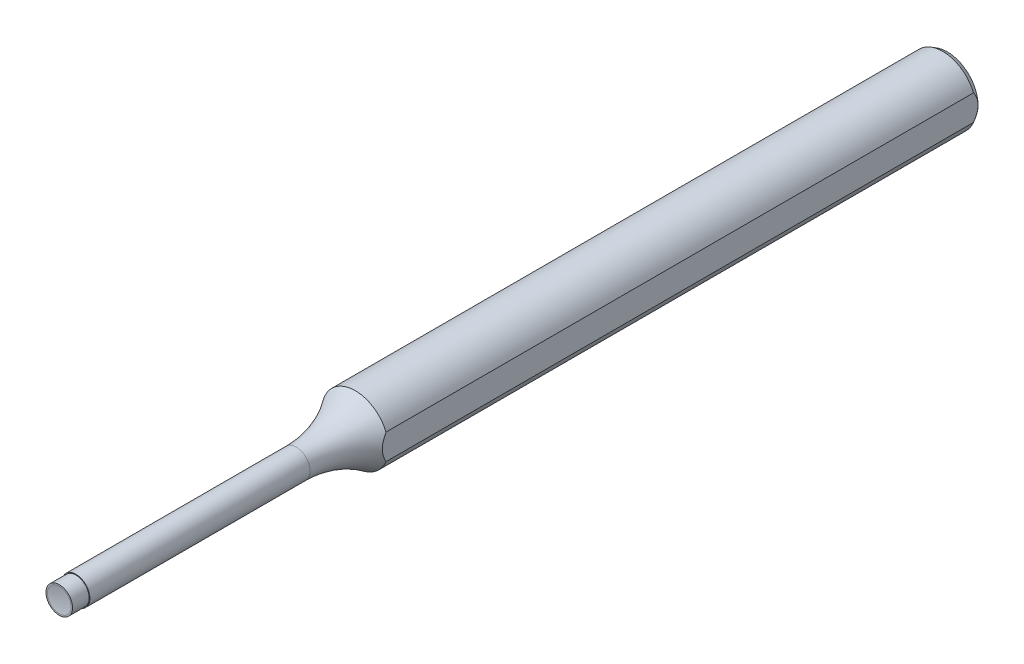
ISO-10303-21;
HEADER;
FILE_DESCRIPTION(('STEP AP214'),'2;1');
FILE_NAME('part.step','',(''),(''),'','','');
FILE_SCHEMA(('AUTOMOTIVE_DESIGN { 1 0 10303 214 1 1 1 1 }'));
ENDSEC;
DATA;
#1=APPLICATION_CONTEXT('core data for automotive mechanical design processes');
#2=APPLICATION_PROTOCOL_DEFINITION('international standard','automotive_design',2000,#1);
#3=PRODUCT_CONTEXT('',#1,'mechanical');
#4=PRODUCT('Part','Part','',(#3));
#5=PRODUCT_RELATED_PRODUCT_CATEGORY('part','',(#4));
#6=PRODUCT_DEFINITION_FORMATION('','',#4);
#7=PRODUCT_DEFINITION_CONTEXT('part definition',#1,'design');
#8=PRODUCT_DEFINITION('design','',#6,#7);
#9=PRODUCT_DEFINITION_SHAPE('','',#8);
#10=(LENGTH_UNIT() NAMED_UNIT(*) SI_UNIT(.MILLI.,.METRE.));
#11=(NAMED_UNIT(*) PLANE_ANGLE_UNIT() SI_UNIT($,.RADIAN.));
#12=(NAMED_UNIT(*) SI_UNIT($,.STERADIAN.) SOLID_ANGLE_UNIT());
#13=UNCERTAINTY_MEASURE_WITH_UNIT(LENGTH_MEASURE(1.E-05),#10,'distance_accuracy_value','');
#14=(GEOMETRIC_REPRESENTATION_CONTEXT(3) GLOBAL_UNCERTAINTY_ASSIGNED_CONTEXT((#13)) GLOBAL_UNIT_ASSIGNED_CONTEXT((#10,
#11,#12)) REPRESENTATION_CONTEXT('',''));
#15=CARTESIAN_POINT('',(0.,0.,0.));
#16=DIRECTION('',(0.,0.,1.));
#17=DIRECTION('',(1.,0.,0.));
#18=AXIS2_PLACEMENT_3D('',#15,#16,#17);
#19=CARTESIAN_POINT('',(0.,0.,-42.3333333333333));
#20=DIRECTION('',(0.,0.,1.));
#21=DIRECTION('',(1.,0.,0.));
#22=AXIS2_PLACEMENT_3D('',#19,#20,#21);
#23=CYLINDRICAL_SURFACE('',#22,2.);
#24=CARTESIAN_POINT('',(0.,0.,-33.8831188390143));
#25=DIRECTION('',(0.,0.,1.));
#26=DIRECTION('',(0.,-1.,0.));
#27=AXIS2_PLACEMENT_3D('',#24,#25,#26);
#28=CIRCLE('',#27,2.);
#29=CARTESIAN_POINT('',(0.,-2.,-33.8831188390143));
#30=VERTEX_POINT('',#29);
#31=EDGE_CURVE('E79',#30,#30,#28,.F.);
#32=ORIENTED_EDGE('',*,*,#31,.F.);
#33=EDGE_LOOP('',(#32));
#34=FACE_BOUND('',#33,.T.);
#35=CARTESIAN_POINT('',(0.,0.,-2.3825));
#36=DIRECTION('',(0.,0.,1.));
#37=DIRECTION('',(1.,0.,0.));
#38=AXIS2_PLACEMENT_3D('',#35,#36,#37);
#39=CIRCLE('',#38,2.);
#40=CARTESIAN_POINT('',(2.,0.,-2.3825));
#41=VERTEX_POINT('',#40);
#42=EDGE_CURVE('E90',#41,#41,#39,.F.);
#43=ORIENTED_EDGE('',*,*,#42,.T.);
#44=EDGE_LOOP('',(#43));
#45=FACE_BOUND('',#44,.T.);
#46=ADVANCED_FACE('F42',(#34,#45),#23,.T.);
#47=CARTESIAN_POINT('',(0.,0.,-2.3825));
#48=DIRECTION('',(0.,0.,1.));
#49=DIRECTION('',(1.,0.,0.));
#50=AXIS2_PLACEMENT_3D('',#47,#48,#49);
#51=PLANE('',#50);
#52=ORIENTED_EDGE('',*,*,#42,.F.);
#53=EDGE_LOOP('',(#52));
#54=FACE_BOUND('',#53,.T.);
#55=CARTESIAN_POINT('',(0.,0.,-2.3825));
#56=DIRECTION('',(0.,0.,1.));
#57=DIRECTION('',(1.,0.,0.));
#58=AXIS2_PLACEMENT_3D('',#55,#56,#57);
#59=CIRCLE('',#58,1.9);
#60=CARTESIAN_POINT('',(1.9,0.,-2.3825));
#61=VERTEX_POINT('',#60);
#62=EDGE_CURVE('E97',#61,#61,#59,.T.);
#63=ORIENTED_EDGE('',*,*,#62,.F.);
#64=EDGE_LOOP('',(#63));
#65=FACE_BOUND('',#64,.T.);
#66=ADVANCED_FACE('F109',(#54,#65),#51,.T.);
#67=CARTESIAN_POINT('',(0.,0.,-2.3825));
#68=DIRECTION('',(0.,0.,1.));
#69=DIRECTION('',(1.,0.,0.));
#70=AXIS2_PLACEMENT_3D('',#67,#68,#69);
#71=CYLINDRICAL_SURFACE('',#70,1.9);
#72=ORIENTED_EDGE('',*,*,#62,.T.);
#73=EDGE_LOOP('',(#72));
#74=FACE_BOUND('',#73,.T.);
#75=CARTESIAN_POINT('',(0.,0.,0.));
#76=DIRECTION('',(0.,0.,1.));
#77=DIRECTION('',(1.,0.,0.));
#78=AXIS2_PLACEMENT_3D('',#75,#76,#77);
#79=CIRCLE('',#78,1.9);
#80=CARTESIAN_POINT('',(1.9,0.,0.));
#81=VERTEX_POINT('',#80);
#82=EDGE_CURVE('E120',#81,#81,#79,.T.);
#83=ORIENTED_EDGE('',*,*,#82,.F.);
#84=EDGE_LOOP('',(#83));
#85=FACE_BOUND('',#84,.T.);
#86=ADVANCED_FACE('F115',(#74,#85),#71,.T.);
#87=CARTESIAN_POINT('',(0.,0.,0.));
#88=DIRECTION('',(0.,0.,1.));
#89=DIRECTION('',(1.,0.,0.));
#90=AXIS2_PLACEMENT_3D('',#87,#88,#89);
#91=PLANE('',#90);
#92=CARTESIAN_POINT('',(0.,0.,0.));
#93=DIRECTION('',(0.,0.,1.));
#94=DIRECTION('',(0.,-1.,0.));
#95=AXIS2_PLACEMENT_3D('',#92,#93,#94);
#96=CIRCLE('',#95,1.7);
#97=CARTESIAN_POINT('',(0.,-1.7,0.));
#98=VERTEX_POINT('',#97);
#99=EDGE_CURVE('E125',#98,#98,#96,.T.);
#100=ORIENTED_EDGE('',*,*,#99,.F.);
#101=EDGE_LOOP('',(#100));
#102=FACE_BOUND('',#101,.T.);
#103=ORIENTED_EDGE('',*,*,#82,.T.);
#104=EDGE_LOOP('',(#103));
#105=FACE_BOUND('',#104,.T.);
#106=ADVANCED_FACE('F157',(#102,#105),#91,.T.);
#107=CARTESIAN_POINT('',(0.,0.,9.37714775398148));
#108=DIRECTION('',(0.,0.,1.));
#109=DIRECTION('',(0.,1.,0.));
#110=AXIS2_PLACEMENT_3D('',#107,#108,#109);
#111=SPHERICAL_SURFACE('',#110,9.53);
#112=ORIENTED_EDGE('',*,*,#99,.T.);
#113=EDGE_LOOP('',(#112));
#114=FACE_BOUND('',#113,.T.);
#115=ADVANCED_FACE('F160',(#114),#111,.F.);
#116=CARTESIAN_POINT('',(0.,0.,-33.8831188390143));
#117=DIRECTION('',(0.,0.,-1.));
#118=DIRECTION('',(0.,1.,0.));
#119=AXIS2_PLACEMENT_3D('',#116,#117,#118);
#120=TOROIDAL_SURFACE('',#119,16.295,14.295);
#121=CARTESIAN_POINT('',(4.39819012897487,11.0449885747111,-47.4819999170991));
#122=CARTESIAN_POINT('',(4.39819012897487,10.7947650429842,-47.4066870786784));
#123=CARTESIAN_POINT('',(4.39819012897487,10.546290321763,-47.3256339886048));
#124=CARTESIAN_POINT('',(4.39819012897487,10.053224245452,-47.1526257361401));
#125=CARTESIAN_POINT('',(4.39819012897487,9.80863204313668,-47.0606729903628));
#126=CARTESIAN_POINT('',(4.39819012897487,9.32422528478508,-46.8666581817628));
#127=CARTESIAN_POINT('',(4.39819012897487,9.08440011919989,-46.7646225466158));
#128=CARTESIAN_POINT('',(4.39819012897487,8.60909073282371,-46.5508837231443));
#129=CARTESIAN_POINT('',(4.39819012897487,8.37360671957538,-46.4391800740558));
#130=CARTESIAN_POINT('',(4.39819012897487,7.91181699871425,-46.209176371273));
#131=CARTESIAN_POINT('',(4.39819012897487,7.68542197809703,-46.0910552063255));
#132=CARTESIAN_POINT('',(4.39819012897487,7.2368869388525,-45.846988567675));
#133=CARTESIAN_POINT('',(4.39819012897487,7.01474709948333,-45.7210427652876));
#134=CARTESIAN_POINT('',(4.39819012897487,6.57446847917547,-45.4621573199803));
#135=CARTESIAN_POINT('',(4.39819012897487,6.35633139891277,-45.3292147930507));
#136=CARTESIAN_POINT('',(4.39819012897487,5.92378803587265,-45.0574142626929));
#137=CARTESIAN_POINT('',(4.39819012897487,5.70938174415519,-44.9185562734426));
#138=CARTESIAN_POINT('',(4.39819012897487,5.29273016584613,-44.6421719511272));
#139=CARTESIAN_POINT('',(4.39819012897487,5.09035537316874,-44.5048399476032));
#140=CARTESIAN_POINT('',(4.39819012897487,4.68766106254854,-44.2272802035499));
#141=CARTESIAN_POINT('',(4.39819012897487,4.48734120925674,-44.0870529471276));
#142=CARTESIAN_POINT('',(4.39819012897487,4.08655969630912,-43.8047975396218));
#143=CARTESIAN_POINT('',(4.39819012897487,3.88610186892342,-43.6627640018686));
#144=CARTESIAN_POINT('',(4.39819012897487,3.48424347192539,-43.3800550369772));
#145=CARTESIAN_POINT('',(4.39819012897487,3.28284299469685,-43.2393794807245));
#146=CARTESIAN_POINT('',(4.39819012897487,2.92966388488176,-42.9992904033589));
#147=CARTESIAN_POINT('',(4.39819012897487,2.77868587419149,-42.8987091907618));
#148=CARTESIAN_POINT('',(4.39819012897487,2.47333321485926,-42.7025794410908));
#149=CARTESIAN_POINT('',(4.39819012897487,2.31895675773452,-42.6070336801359));
#150=CARTESIAN_POINT('',(4.39819012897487,2.005761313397,-42.4246557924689));
#151=CARTESIAN_POINT('',(4.39819012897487,1.84695880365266,-42.3377957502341));
#152=CARTESIAN_POINT('',(4.39819012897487,1.52277481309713,-42.1773799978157));
#153=CARTESIAN_POINT('',(4.39819012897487,1.35740223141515,-42.1038069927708));
#154=CARTESIAN_POINT('',(4.39819012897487,1.09987996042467,-42.007160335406));
#155=CARTESIAN_POINT('',(4.39819012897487,1.01049289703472,-41.976753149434));
#156=CARTESIAN_POINT('',(4.39819012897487,0.829699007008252,-41.9225917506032));
#157=CARTESIAN_POINT('',(4.39819012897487,0.738292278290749,-41.8988372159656));
#158=CARTESIAN_POINT('',(4.39819012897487,0.554209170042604,-41.8591940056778));
#159=CARTESIAN_POINT('',(4.39819012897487,0.461540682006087,-41.8432692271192));
#160=CARTESIAN_POINT('',(4.39819012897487,0.27512215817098,-41.8200165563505));
#161=CARTESIAN_POINT('',(4.39819012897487,0.181372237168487,-41.8126877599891));
#162=CARTESIAN_POINT('',(4.39819012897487,-0.00699658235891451,-41.807066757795));
#163=CARTESIAN_POINT('',(4.39819012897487,-0.101617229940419,-41.8088319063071));
#164=CARTESIAN_POINT('',(4.39819012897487,-0.290248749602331,-41.821416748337));
#165=CARTESIAN_POINT('',(4.39819012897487,-0.38425957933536,-41.8322370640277));
#166=CARTESIAN_POINT('',(4.39819012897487,-0.571301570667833,-41.8623308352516));
#167=CARTESIAN_POINT('',(4.39819012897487,-0.664326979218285,-41.8816395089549));
#168=CARTESIAN_POINT('',(4.39819012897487,-0.848491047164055,-41.9276817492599));
#169=CARTESIAN_POINT('',(4.39819012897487,-0.939629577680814,-41.9544158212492));
#170=CARTESIAN_POINT('',(4.39819012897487,-1.22609602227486,-42.0493425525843));
#171=CARTESIAN_POINT('',(4.39819012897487,-1.41755339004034,-42.1292488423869));
#172=CARTESIAN_POINT('',(4.39819012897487,-1.69784846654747,-42.2630803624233));
#173=CARTESIAN_POINT('',(4.39819012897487,-1.79024221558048,-42.3100867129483));
#174=CARTESIAN_POINT('',(4.39819012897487,-1.97308040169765,-42.4077596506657));
#175=CARTESIAN_POINT('',(4.39819012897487,-2.06352516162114,-42.4584256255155));
#176=CARTESIAN_POINT('',(4.39819012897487,-2.24410996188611,-42.5633271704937));
#177=CARTESIAN_POINT('',(4.39819012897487,-2.3342252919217,-42.6176047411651));
#178=CARTESIAN_POINT('',(4.39819012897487,-2.51311006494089,-42.7283328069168));
#179=CARTESIAN_POINT('',(4.39819012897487,-2.60187947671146,-42.7847833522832));
#180=CARTESIAN_POINT('',(4.39819012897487,-2.77831480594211,-42.8992495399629));
#181=CARTESIAN_POINT('',(4.39819012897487,-2.86598141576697,-42.9572641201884));
#182=CARTESIAN_POINT('',(4.39819012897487,-3.04053934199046,-43.0744413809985));
#183=CARTESIAN_POINT('',(4.39819012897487,-3.12743067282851,-43.133604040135));
#184=CARTESIAN_POINT('',(4.39819012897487,-3.37106605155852,-43.3010856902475));
#185=CARTESIAN_POINT('',(4.39819012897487,-3.52720183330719,-43.4102864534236));
#186=CARTESIAN_POINT('',(4.39819012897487,-3.83888063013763,-43.629533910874));
#187=CARTESIAN_POINT('',(4.39819012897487,-3.99442362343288,-43.7395806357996));
#188=CARTESIAN_POINT('',(4.39819012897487,-4.30578651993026,-43.9593057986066));
#189=CARTESIAN_POINT('',(4.39819012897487,-4.46160644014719,-44.0689842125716));
#190=CARTESIAN_POINT('',(4.39819012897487,-4.77416550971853,-44.2870260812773));
#191=CARTESIAN_POINT('',(4.39819012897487,-4.93090465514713,-44.3953895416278));
#192=CARTESIAN_POINT('',(4.39819012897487,-5.24552277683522,-44.6098721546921));
#193=CARTESIAN_POINT('',(4.39819012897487,-5.40339933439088,-44.7159948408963));
#194=CARTESIAN_POINT('',(4.39819012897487,-5.72090882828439,-44.9255777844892));
#195=CARTESIAN_POINT('',(4.39819012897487,-5.88054176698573,-45.0290380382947));
#196=CARTESIAN_POINT('',(4.39819012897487,-6.36249082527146,-45.3346345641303));
#197=CARTESIAN_POINT('',(4.39819012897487,-6.68787179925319,-45.5319967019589));
#198=CARTESIAN_POINT('',(4.39819012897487,-7.33445229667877,-45.9028473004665));
#199=CARTESIAN_POINT('',(4.39819012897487,-7.65527975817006,-46.0769816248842));
#200=CARTESIAN_POINT('',(4.39819012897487,-8.30567517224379,-46.4080211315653));
#201=CARTESIAN_POINT('',(4.39819012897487,-8.635241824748,-46.5649288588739));
#202=CARTESIAN_POINT('',(4.39819012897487,-9.30675508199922,-46.8612686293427));
#203=CARTESIAN_POINT('',(4.39819012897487,-9.64880070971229,-47.0004778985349));
#204=CARTESIAN_POINT('',(4.39819012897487,-10.1679107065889,-47.1932985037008));
#205=CARTESIAN_POINT('',(4.39819012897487,-10.3420274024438,-47.2549286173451));
#206=CARTESIAN_POINT('',(4.39819012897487,-10.692133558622,-47.3726581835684));
#207=CARTESIAN_POINT('',(4.39819012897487,-10.8681231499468,-47.4287572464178));
#208=CARTESIAN_POINT('',(4.39819012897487,-11.0449885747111,-47.4819999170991));
#209=B_SPLINE_CURVE_WITH_KNOTS('',3,(#121,#122,#123,#124,#125,#126,#127,#128,#129,#130,#131,
#132,#133,#134,#135,#136,#137,#138,#139,#140,#141,#142,#143,#144,#145,#146,#147,#148,#149,#150,
#151,#152,#153,#154,#155,#156,#157,#158,#159,#160,#161,#162,#163,#164,#165,#166,#167,#168,#169,
#170,#171,#172,#173,#174,#175,#176,#177,#178,#179,#180,#181,#182,#183,#184,#185,#186,#187,#188,
#189,#190,#191,#192,#193,#194,#195,#196,#197,#198,#199,#200,#201,#202,#203,#204,#205,#206,#207,
#208),.UNSPECIFIED.,.F.,.F.,(4,2,2,2,2,2,2,2,2,2,2,2,2,2,2,2,2,2,2,2,2,2,2,2,2,2,2,2,2,2,2,2,2,
2,2,2,2,2,2,2,2,2,2,4),(0.,0.783837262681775,1.56750106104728,2.34916273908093,3.13086169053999,
3.89676597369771,4.66270245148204,5.42895715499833,6.19521002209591,6.92888889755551,
7.66244607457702,8.39948186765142,9.13644688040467,9.68063581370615,10.2251216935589,
10.7677972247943,11.3097612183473,11.5928058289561,11.875836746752,12.1575500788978,
12.4392337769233,12.722696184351,13.0061780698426,13.2908473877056,13.5755360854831,
14.1959332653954,14.5069059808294,14.8178267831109,15.1333896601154,15.4489598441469,
15.7643208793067,16.0796760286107,16.6512649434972,17.2228746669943,17.7945208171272,
18.366164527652,18.9368268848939,19.507490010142,20.6487630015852,21.7434198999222,
22.8379148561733,23.9450511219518,24.499076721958,25.0531413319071),.UNSPECIFIED.);
#210=CARTESIAN_POINT('',(4.39819012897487,1.83334355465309,-42.3333333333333));
#211=VERTEX_POINT('',#210);
#212=CARTESIAN_POINT('',(4.39819012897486,-1.83334355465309,-42.3333333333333));
#213=VERTEX_POINT('',#212);
#214=EDGE_CURVE('E58',#211,#213,#209,.T.);
#215=ORIENTED_EDGE('',*,*,#214,.F.);
#216=CARTESIAN_POINT('',(0.,0.,-42.3333333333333));
#217=DIRECTION('',(0.,0.,-1.));
#218=DIRECTION('',(0.,1.,0.));
#219=AXIS2_PLACEMENT_3D('',#216,#217,#218);
#220=CIRCLE('',#219,4.76499999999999);
#221=EDGE_CURVE('E130',#213,#211,#220,.T.);
#222=ORIENTED_EDGE('',*,*,#221,.F.);
#223=EDGE_LOOP('',(#215,#222));
#224=FACE_BOUND('',#223,.T.);
#225=ORIENTED_EDGE('',*,*,#31,.T.);
#226=EDGE_LOOP('',(#225));
#227=FACE_BOUND('',#226,.T.);
#228=ADVANCED_FACE('F105',(#224,#227),#120,.F.);
#229=CARTESIAN_POINT('',(0.,0.,-127.));
#230=DIRECTION('',(0.,0.,1.));
#231=DIRECTION('',(1.,0.,0.));
#232=AXIS2_PLACEMENT_3D('',#229,#230,#231);
#233=PLANE('',#232);
#234=CARTESIAN_POINT('',(0.,0.,-127.));
#235=DIRECTION('',(0.,0.,1.));
#236=DIRECTION('',(1.,0.,0.));
#237=AXIS2_PLACEMENT_3D('',#234,#235,#236);
#238=CIRCLE('',#237,4.39819012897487);
#239=CARTESIAN_POINT('',(4.39819012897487,0.,-127.));
#240=VERTEX_POINT('',#239);
#241=EDGE_CURVE('E85',#240,#240,#238,.F.);
#242=ORIENTED_EDGE('',*,*,#241,.T.);
#243=EDGE_LOOP('',(#242));
#244=FACE_BOUND('',#243,.T.);
#245=ADVANCED_FACE('F155',(#244),#233,.F.);
#246=CARTESIAN_POINT('',(0.,0.,-126.364666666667));
#247=DIRECTION('',(0.,0.,1.));
#248=DIRECTION('',(1.,0.,0.));
#249=AXIS2_PLACEMENT_3D('',#246,#247,#248);
#250=CONICAL_SURFACE('',#249,4.765,0.523598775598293);
#251=CARTESIAN_POINT('',(4.39819012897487,-5.33423797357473,-122.64314394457));
#252=CARTESIAN_POINT('',(4.39819012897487,-5.23964449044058,-122.769540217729));
#253=CARTESIAN_POINT('',(4.39819012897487,-5.14441079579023,-122.895461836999));
#254=CARTESIAN_POINT('',(4.39819012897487,-4.95244135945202,-123.14617446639));
#255=CARTESIAN_POINT('',(4.39819012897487,-4.85570546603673,-123.270965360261));
#256=CARTESIAN_POINT('',(4.39819012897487,-4.66025992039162,-123.519551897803));
#257=CARTESIAN_POINT('',(4.39819012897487,-4.56154555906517,-123.643343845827));
#258=CARTESIAN_POINT('',(4.39819012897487,-4.36213663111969,-123.889318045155));
#259=CARTESIAN_POINT('',(4.39819012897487,-4.26144213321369,-124.01150035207));
#260=CARTESIAN_POINT('',(4.39819012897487,-4.05667136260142,-124.255205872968));
#261=CARTESIAN_POINT('',(4.39819012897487,-3.95257064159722,-124.376708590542));
#262=CARTESIAN_POINT('',(4.39819012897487,-3.74160194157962,-124.617285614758));
#263=CARTESIAN_POINT('',(4.39819012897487,-3.63473408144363,-124.73636002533));
#264=CARTESIAN_POINT('',(4.39819012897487,-3.41782749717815,-124.971366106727));
#265=CARTESIAN_POINT('',(4.39819012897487,-3.30779217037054,-125.087300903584));
#266=CARTESIAN_POINT('',(4.39819012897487,-3.08382779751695,-125.315332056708));
#267=CARTESIAN_POINT('',(4.39819012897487,-2.96989944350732,-125.427429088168));
#268=CARTESIAN_POINT('',(4.39819012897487,-2.77186488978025,-125.614120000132));
#269=CARTESIAN_POINT('',(4.39819012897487,-2.68894403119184,-125.68996971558));
#270=CARTESIAN_POINT('',(4.39819012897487,-2.52044667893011,-125.838685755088));
#271=CARTESIAN_POINT('',(4.39819012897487,-2.43486999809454,-125.911551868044));
#272=CARTESIAN_POINT('',(4.39819012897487,-2.26054924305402,-126.053736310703));
#273=CARTESIAN_POINT('',(4.39819012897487,-2.17179979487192,-126.123048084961));
#274=CARTESIAN_POINT('',(4.39819012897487,-1.99088174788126,-126.257087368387));
#275=CARTESIAN_POINT('',(4.39819012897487,-1.89871312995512,-126.321814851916));
#276=CARTESIAN_POINT('',(4.39819012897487,-1.7090542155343,-126.446513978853));
#277=CARTESIAN_POINT('',(4.39819012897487,-1.61150226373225,-126.506392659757));
#278=CARTESIAN_POINT('',(4.39819012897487,-1.41210644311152,-126.618657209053));
#279=CARTESIAN_POINT('',(4.39819012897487,-1.31026180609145,-126.671041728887));
#280=CARTESIAN_POINT('',(4.39819012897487,-1.10269294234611,-126.766129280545));
#281=CARTESIAN_POINT('',(4.39819012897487,-0.996989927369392,-126.808878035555));
#282=CARTESIAN_POINT('',(4.39819012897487,-0.781614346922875,-126.882793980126));
#283=CARTESIAN_POINT('',(4.39819012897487,-0.67194529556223,-126.913971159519));
#284=CARTESIAN_POINT('',(4.39819012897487,-0.488020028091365,-126.954270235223));
#285=CARTESIAN_POINT('',(4.39819012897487,-0.414608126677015,-126.967290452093));
#286=CARTESIAN_POINT('',(4.39819012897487,-0.266950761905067,-126.987044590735));
#287=CARTESIAN_POINT('',(4.39819012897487,-0.192705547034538,-126.993780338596));
#288=CARTESIAN_POINT('',(4.39819012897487,-0.0439156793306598,-127.000708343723));
#289=CARTESIAN_POINT('',(4.39819012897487,0.0306289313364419,-127.000901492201));
#290=CARTESIAN_POINT('',(4.39819012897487,0.179435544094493,-126.994754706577));
#291=CARTESIAN_POINT('',(4.39819012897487,0.253697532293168,-126.988414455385));
#292=CARTESIAN_POINT('',(4.39819012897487,0.474629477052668,-126.959962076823));
#293=CARTESIAN_POINT('',(4.39819012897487,0.620159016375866,-126.928448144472));
#294=CARTESIAN_POINT('',(4.39819012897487,0.904823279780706,-126.844288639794));
#295=CARTESIAN_POINT('',(4.39819012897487,1.04395187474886,-126.791623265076));
#296=CARTESIAN_POINT('',(4.39819012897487,1.30222792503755,-126.675763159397));
#297=CARTESIAN_POINT('',(4.39819012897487,1.42203206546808,-126.61399704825));
#298=CARTESIAN_POINT('',(4.39819012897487,1.65585339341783,-126.480248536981));
#299=CARTESIAN_POINT('',(4.39819012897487,1.76986529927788,-126.40825703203));
#300=CARTESIAN_POINT('',(4.39819012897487,1.99362460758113,-126.255843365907));
#301=CARTESIAN_POINT('',(4.39819012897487,2.10332163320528,-126.175348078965));
#302=CARTESIAN_POINT('',(4.39819012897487,2.31795882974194,-126.008389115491));
#303=CARTESIAN_POINT('',(4.39819012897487,2.42290098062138,-125.921927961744));
#304=CARTESIAN_POINT('',(4.39819012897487,2.66383353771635,-125.714113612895));
#305=CARTESIAN_POINT('',(4.39819012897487,2.79822037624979,-125.590909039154));
#306=CARTESIAN_POINT('',(4.39819012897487,3.0611757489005,-125.338408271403));
#307=CARTESIAN_POINT('',(4.39819012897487,3.18974214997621,-125.209109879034));
#308=CARTESIAN_POINT('',(4.39819012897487,3.44236417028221,-124.945697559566));
#309=CARTESIAN_POINT('',(4.39819012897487,3.56641012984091,-124.811574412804));
#310=CARTESIAN_POINT('',(4.39819012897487,3.81058734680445,-124.539807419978));
#311=CARTESIAN_POINT('',(4.39819012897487,3.93071829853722,-124.402163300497));
#312=CARTESIAN_POINT('',(4.39819012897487,4.16130930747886,-124.131643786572));
#313=CARTESIAN_POINT('',(4.39819012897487,4.27194072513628,-123.998913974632));
#314=CARTESIAN_POINT('',(4.39819012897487,4.49075134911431,-123.731440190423));
#315=CARTESIAN_POINT('',(4.39819012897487,4.59893042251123,-123.59669610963));
#316=CARTESIAN_POINT('',(4.39819012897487,4.81265144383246,-123.326247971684));
#317=CARTESIAN_POINT('',(4.39819012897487,4.91820400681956,-123.190552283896));
#318=CARTESIAN_POINT('',(4.39819012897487,5.12750213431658,-122.917805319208));
#319=CARTESIAN_POINT('',(4.39819012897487,5.23124796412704,-122.780754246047));
#320=CARTESIAN_POINT('',(4.39819012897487,5.33423797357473,-122.64314394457));
#321=B_SPLINE_CURVE_WITH_KNOTS('',3,(#251,#252,#253,#254,#255,#256,#257,#258,#259,#260,#261,
#262,#263,#264,#265,#266,#267,#268,#269,#270,#271,#272,#273,#274,#275,#276,#277,#278,#279,#280,
#281,#282,#283,#284,#285,#286,#287,#288,#289,#290,#291,#292,#293,#294,#295,#296,#297,#298,#299,
#300,#301,#302,#303,#304,#305,#306,#307,#308,#309,#310,#311,#312,#313,#314,#315,#316,#317,#318,
#319,#320),.UNSPECIFIED.,.F.,.F.,(4,2,2,2,2,2,2,2,2,2,2,2,2,2,2,2,2,2,2,2,2,2,2,2,2,2,2,2,2,2,2,
2,2,2,4),(0.,0.473622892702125,0.947293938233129,1.42227179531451,1.89723319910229,
2.37719719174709,2.85714059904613,3.33658712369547,3.81594885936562,4.15302867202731,
4.49013229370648,4.82783680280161,5.16554320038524,5.50866767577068,5.85185381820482,
6.19337550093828,6.53460165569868,6.75803376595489,6.98140093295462,7.20473767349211,
7.42808525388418,7.87266697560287,8.31766589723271,8.72141386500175,9.12552361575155,
9.53344563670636,9.94119620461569,10.4878713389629,11.0347452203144,11.5827263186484,
12.1307500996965,12.6490872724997,13.1674524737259,13.6831809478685,14.1988330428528),.UNSPECIFIED.);
#322=CARTESIAN_POINT('',(4.39819012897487,-1.83334355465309,-126.364666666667));
#323=VERTEX_POINT('',#322);
#324=EDGE_CURVE('E73',#323,#240,#321,.T.);
#325=ORIENTED_EDGE('',*,*,#324,.F.);
#326=CARTESIAN_POINT('',(0.,0.,-126.364666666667));
#327=DIRECTION('',(0.,0.,1.));
#328=DIRECTION('',(1.,0.,0.));
#329=AXIS2_PLACEMENT_3D('',#326,#327,#328);
#330=CIRCLE('',#329,4.765);
#331=CARTESIAN_POINT('',(4.39819012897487,1.83334355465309,-126.364666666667));
#332=VERTEX_POINT('',#331);
#333=EDGE_CURVE('E83',#332,#323,#330,.T.);
#334=ORIENTED_EDGE('',*,*,#333,.F.);
#335=EDGE_CURVE('E64',#240,#332,#321,.T.);
#336=ORIENTED_EDGE('',*,*,#335,.F.);
#337=ORIENTED_EDGE('',*,*,#241,.F.);
#338=EDGE_LOOP('',(#325,#334,#336,#337));
#339=FACE_BOUND('',#338,.T.);
#340=ADVANCED_FACE('F44',(#339),#250,.T.);
#341=CARTESIAN_POINT('',(0.,0.,-127.));
#342=DIRECTION('',(0.,0.,1.));
#343=DIRECTION('',(1.,0.,0.));
#344=AXIS2_PLACEMENT_3D('',#341,#342,#343);
#345=CYLINDRICAL_SURFACE('',#344,4.765);
#346=DIRECTION('',(0.,0.,1.));
#347=VECTOR('',#346,1.);
#348=CARTESIAN_POINT('',(4.39819012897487,1.83334355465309,-127.));
#349=LINE('',#348,#347);
#350=EDGE_CURVE('E13',#332,#211,#349,.T.);
#351=ORIENTED_EDGE('',*,*,#350,.F.);
#352=ORIENTED_EDGE('',*,*,#333,.T.);
#353=DIRECTION('',(0.,0.,1.));
#354=VECTOR('',#353,1.);
#355=CARTESIAN_POINT('',(4.39819012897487,-1.83334355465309,-127.));
#356=LINE('',#355,#354);
#357=EDGE_CURVE('E52',#213,#323,#356,.F.);
#358=ORIENTED_EDGE('',*,*,#357,.F.);
#359=ORIENTED_EDGE('',*,*,#221,.T.);
#360=EDGE_LOOP('',(#351,#352,#358,#359));
#361=FACE_BOUND('',#360,.T.);
#362=ADVANCED_FACE('F88',(#361),#345,.T.);
#363=CARTESIAN_POINT('',(4.39819012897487,1.83334355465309,0.));
#364=DIRECTION('',(-1.,0.,0.));
#365=DIRECTION('',(0.,0.,1.));
#366=AXIS2_PLACEMENT_3D('',#363,#364,#365);
#367=PLANE('',#366);
#368=ORIENTED_EDGE('',*,*,#214,.T.);
#369=ORIENTED_EDGE('',*,*,#357,.T.);
#370=ORIENTED_EDGE('',*,*,#324,.T.);
#371=ORIENTED_EDGE('',*,*,#335,.T.);
#372=ORIENTED_EDGE('',*,*,#350,.T.);
#373=EDGE_LOOP('',(#368,#369,#370,#371,#372));
#374=FACE_BOUND('',#373,.T.);
#375=ADVANCED_FACE('F72',(#374),#367,.F.);
#376=CLOSED_SHELL('',(#46,#66,#86,#106,#115,#228,#245,#340,#362,#375));
#377=MANIFOLD_SOLID_BREP('B2',#376);
#378=ADVANCED_BREP_SHAPE_REPRESENTATION('',(#18,#377),#14);
#379=SHAPE_DEFINITION_REPRESENTATION(#9,#378);
ENDSEC;
END-ISO-10303-21;
